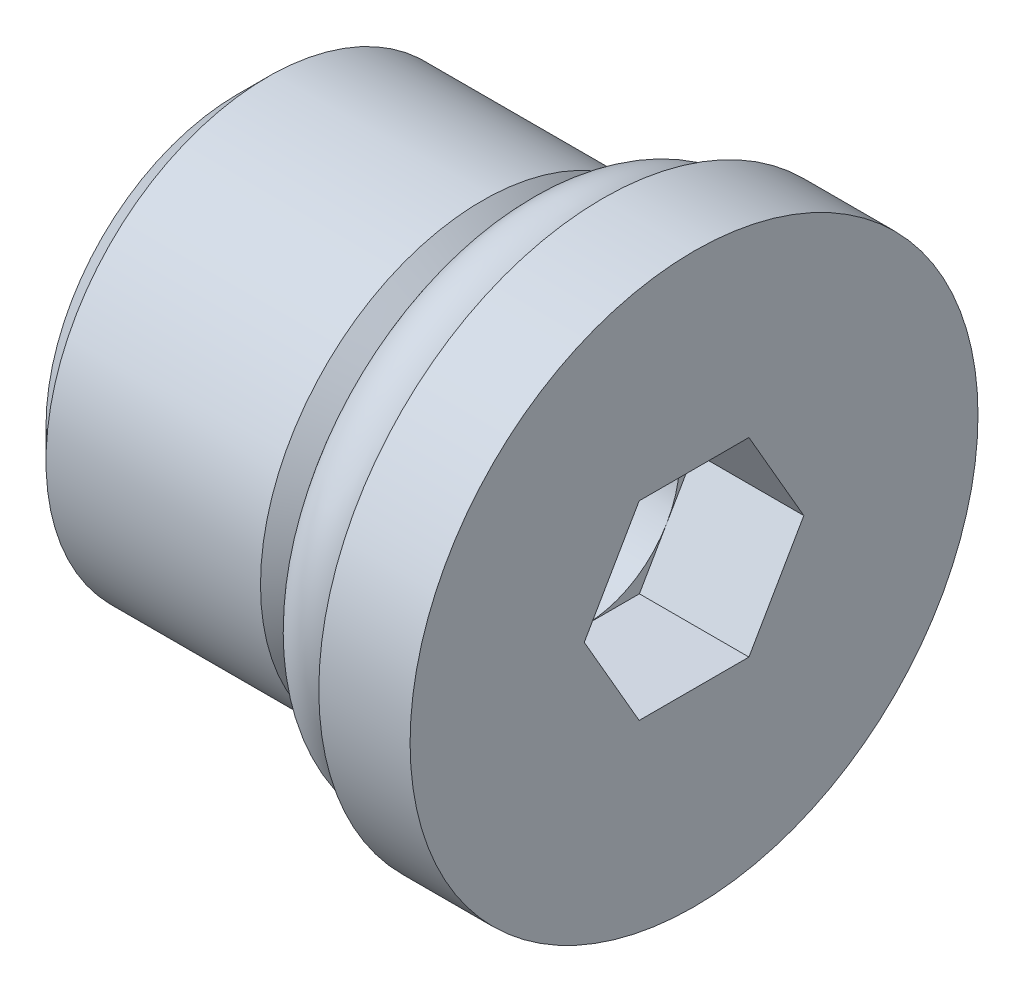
ISO-10303-21;
HEADER;
FILE_DESCRIPTION(('STEP AP214'),'2;1');
FILE_NAME('part.step','',(''),(''),'','','');
FILE_SCHEMA(('AUTOMOTIVE_DESIGN { 1 0 10303 214 1 1 1 1 }'));
ENDSEC;
DATA;
#1=APPLICATION_CONTEXT('core data for automotive mechanical design processes');
#2=APPLICATION_PROTOCOL_DEFINITION('international standard','automotive_design',2000,#1);
#3=PRODUCT_CONTEXT('',#1,'mechanical');
#4=PRODUCT('Part','Part','',(#3));
#5=PRODUCT_RELATED_PRODUCT_CATEGORY('part','',(#4));
#6=PRODUCT_DEFINITION_FORMATION('','',#4);
#7=PRODUCT_DEFINITION_CONTEXT('part definition',#1,'design');
#8=PRODUCT_DEFINITION('design','',#6,#7);
#9=PRODUCT_DEFINITION_SHAPE('','',#8);
#10=(LENGTH_UNIT() NAMED_UNIT(*) SI_UNIT(.MILLI.,.METRE.));
#11=(NAMED_UNIT(*) PLANE_ANGLE_UNIT() SI_UNIT($,.RADIAN.));
#12=(NAMED_UNIT(*) SI_UNIT($,.STERADIAN.) SOLID_ANGLE_UNIT());
#13=UNCERTAINTY_MEASURE_WITH_UNIT(LENGTH_MEASURE(1.E-05),#10,'distance_accuracy_value','');
#14=(GEOMETRIC_REPRESENTATION_CONTEXT(3) GLOBAL_UNCERTAINTY_ASSIGNED_CONTEXT((#13)) GLOBAL_UNIT_ASSIGNED_CONTEXT((#10,
#11,#12)) REPRESENTATION_CONTEXT('',''));
#15=CARTESIAN_POINT('',(0.,0.,0.));
#16=DIRECTION('',(0.,0.,1.));
#17=DIRECTION('',(1.,0.,0.));
#18=AXIS2_PLACEMENT_3D('',#15,#16,#17);
#19=CARTESIAN_POINT('',(0.,0.,2.40030000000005));
#20=DIRECTION('',(-1.,0.,0.));
#21=DIRECTION('',(0.,0.,1.));
#22=AXIS2_PLACEMENT_3D('',#19,#20,#21);
#23=PLANE('',#22);
#24=CARTESIAN_POINT('',(0.,0.,0.));
#25=DIRECTION('',(1.,0.,0.));
#26=DIRECTION('',(0.,0.,-1.));
#27=AXIS2_PLACEMENT_3D('',#24,#25,#26);
#28=CIRCLE('',#27,4.80060000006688);
#29=CARTESIAN_POINT('',(0.,0.,-4.80060000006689));
#30=VERTEX_POINT('',#29);
#31=EDGE_CURVE('P0_E22',#30,#30,#28,.T.);
#32=ORIENTED_EDGE('',*,*,#31,.F.);
#33=EDGE_LOOP('',(#32));
#34=FACE_BOUND('',#33,.T.);
#35=ADVANCED_FACE('P0_F19',(#34),#23,.T.);
#36=CARTESIAN_POINT('',(0.755649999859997,0.,0.));
#37=DIRECTION('',(1.,0.,0.));
#38=DIRECTION('',(0.,0.,-1.));
#39=AXIS2_PLACEMENT_3D('',#36,#37,#38);
#40=CONICAL_SURFACE('',#39,5.55624999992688,0.785398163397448);
#41=CARTESIAN_POINT('',(0.755649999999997,0.,0.));
#42=DIRECTION('',(1.,0.,0.));
#43=DIRECTION('',(0.,0.,-1.));
#44=AXIS2_PLACEMENT_3D('',#41,#42,#43);
#45=CIRCLE('',#44,5.55625);
#46=CARTESIAN_POINT('',(0.755649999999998,0.,-5.55625000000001));
#47=VERTEX_POINT('',#46);
#48=EDGE_CURVE('P0_E202',#47,#47,#45,.T.);
#49=ORIENTED_EDGE('',*,*,#48,.F.);
#50=EDGE_LOOP('',(#49));
#51=FACE_BOUND('',#50,.T.);
#52=ORIENTED_EDGE('',*,*,#31,.T.);
#53=EDGE_LOOP('',(#52));
#54=FACE_BOUND('',#53,.T.);
#55=ADVANCED_FACE('P0_F532',(#51,#54),#40,.T.);
#56=CARTESIAN_POINT('',(8.68679999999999,0.,0.));
#57=DIRECTION('',(-1.,0.,0.));
#58=DIRECTION('',(0.,0.,1.));
#59=AXIS2_PLACEMENT_3D('',#56,#57,#58);
#60=PLANE('',#59);
#61=DIRECTION('',(0.,0.,1.));
#62=VECTOR('',#61,1.);
#63=CARTESIAN_POINT('',(8.68679999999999,-2.38125,0.));
#64=LINE('',#63,#62);
#65=CARTESIAN_POINT('',(8.68679999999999,-2.38125,-1.37481532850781));
#66=VERTEX_POINT('',#65);
#67=CARTESIAN_POINT('',(8.68679999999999,-2.38125,0.));
#68=VERTEX_POINT('',#67);
#69=EDGE_CURVE('P0_E93',#66,#68,#64,.T.);
#70=ORIENTED_EDGE('',*,*,#69,.F.);
#71=DIRECTION('',(0.,-0.86602540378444,0.500000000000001));
#72=VECTOR('',#71,1.);
#73=CARTESIAN_POINT('',(8.68679999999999,-1.190625,-2.06222299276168));
#74=LINE('',#73,#72);
#75=CARTESIAN_POINT('',(8.68679999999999,-1.190625,-2.06222299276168));
#76=VERTEX_POINT('',#75);
#77=EDGE_CURVE('P0_E117',#76,#66,#74,.T.);
#78=ORIENTED_EDGE('',*,*,#77,.F.);
#79=CARTESIAN_POINT('',(8.68679999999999,0.,0.));
#80=DIRECTION('',(-1.,0.,0.));
#81=DIRECTION('',(0.,0.,1.));
#82=AXIS2_PLACEMENT_3D('',#79,#80,#81);
#83=CIRCLE('',#82,2.38125);
#84=EDGE_CURVE('P0_E124',#76,#68,#83,.T.);
#85=ORIENTED_EDGE('',*,*,#84,.T.);
#86=EDGE_LOOP('',(#70,#78,#85));
#87=FACE_BOUND('',#86,.T.);
#88=ADVANCED_FACE('P0_F123',(#87),#60,.F.);
#89=CARTESIAN_POINT('',(8.68679999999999,0.,0.));
#90=DIRECTION('',(-1.,0.,0.));
#91=DIRECTION('',(0.,0.,1.));
#92=AXIS2_PLACEMENT_3D('',#89,#90,#91);
#93=PLANE('',#92);
#94=DIRECTION('',(0.,0.86602540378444,0.500000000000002));
#95=VECTOR('',#94,1.);
#96=CARTESIAN_POINT('',(8.68679999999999,-2.38125000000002,1.37481532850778));
#97=LINE('',#96,#95);
#98=CARTESIAN_POINT('',(8.68679999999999,-2.38125000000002,1.37481532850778));
#99=VERTEX_POINT('',#98);
#100=CARTESIAN_POINT('',(8.68679999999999,-1.190625,2.06222299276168));
#101=VERTEX_POINT('',#100);
#102=EDGE_CURVE('P0_E207',#99,#101,#97,.T.);
#103=ORIENTED_EDGE('',*,*,#102,.F.);
#104=DIRECTION('',(0.,0.,1.));
#105=VECTOR('',#104,1.);
#106=CARTESIAN_POINT('',(8.68679999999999,-2.38125,0.));
#107=LINE('',#106,#105);
#108=EDGE_CURVE('P0_E309',#68,#99,#107,.T.);
#109=ORIENTED_EDGE('',*,*,#108,.F.);
#110=CARTESIAN_POINT('',(8.68679999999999,0.,0.));
#111=DIRECTION('',(-1.,0.,0.));
#112=DIRECTION('',(0.,0.,1.));
#113=AXIS2_PLACEMENT_3D('',#110,#111,#112);
#114=CIRCLE('',#113,2.38125);
#115=EDGE_CURVE('P0_E132',#68,#101,#114,.T.);
#116=ORIENTED_EDGE('',*,*,#115,.T.);
#117=EDGE_LOOP('',(#103,#109,#116));
#118=FACE_BOUND('',#117,.T.);
#119=ADVANCED_FACE('P0_F308',(#118),#93,.F.);
#120=CARTESIAN_POINT('',(3.44169999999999,0.,0.));
#121=DIRECTION('',(1.,0.,0.));
#122=DIRECTION('',(0.,0.,-1.));
#123=AXIS2_PLACEMENT_3D('',#120,#121,#122);
#124=CYLINDRICAL_SURFACE('',#123,5.55625);
#125=CARTESIAN_POINT('',(6.12775000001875,0.,0.));
#126=DIRECTION('',(-1.,0.,0.));
#127=DIRECTION('',(0.,0.,1.));
#128=AXIS2_PLACEMENT_3D('',#125,#126,#127);
#129=CIRCLE('',#128,5.55624999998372);
#130=CARTESIAN_POINT('',(6.12775000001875,0.,5.55624999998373));
#131=VERTEX_POINT('',#130);
#132=EDGE_CURVE('P0_E138',#131,#131,#129,.F.);
#133=ORIENTED_EDGE('',*,*,#132,.F.);
#134=EDGE_LOOP('',(#133));
#135=FACE_BOUND('',#134,.T.);
#136=ORIENTED_EDGE('',*,*,#48,.T.);
#137=EDGE_LOOP('',(#136));
#138=FACE_BOUND('',#137,.T.);
#139=ADVANCED_FACE('P0_F343',(#135,#138),#124,.T.);
#140=CARTESIAN_POINT('',(5.94359999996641,0.,0.));
#141=DIRECTION('',(1.,0.,0.));
#142=DIRECTION('',(0.,0.,-1.));
#143=AXIS2_PLACEMENT_3D('',#140,#141,#142);
#144=CONICAL_SURFACE('',#143,2.3812499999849,1.02974425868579);
#145=CARTESIAN_POINT('',(4.512800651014,0.,0.));
#146=VERTEX_POINT('',#145);
#147=VERTEX_LOOP('',#146);
#148=FACE_BOUND('',#147,.T.);
#149=CARTESIAN_POINT('',(5.94360000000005,0.,0.));
#150=DIRECTION('',(-1.,0.,0.));
#151=DIRECTION('',(0.,0.,1.));
#152=AXIS2_PLACEMENT_3D('',#149,#150,#151);
#153=CIRCLE('',#152,2.38125);
#154=CARTESIAN_POINT('',(5.94360000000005,0.,2.38125));
#155=VERTEX_POINT('',#154);
#156=EDGE_CURVE('P0_E147',#155,#155,#153,.F.);
#157=ORIENTED_EDGE('',*,*,#156,.T.);
#158=EDGE_LOOP('',(#157));
#159=FACE_BOUND('',#158,.T.);
#160=ADVANCED_FACE('P0_F335',(#148,#159),#144,.F.);
#161=CARTESIAN_POINT('',(8.68679999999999,0.,0.));
#162=DIRECTION('',(-1.,0.,0.));
#163=DIRECTION('',(0.,0.,1.));
#164=AXIS2_PLACEMENT_3D('',#161,#162,#163);
#165=PLANE('',#164);
#166=DIRECTION('',(0.,0.,1.));
#167=VECTOR('',#166,1.);
#168=CARTESIAN_POINT('',(8.68679999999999,2.38125,0.));
#169=LINE('',#168,#167);
#170=CARTESIAN_POINT('',(8.68679999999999,2.38125,1.37481532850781));
#171=VERTEX_POINT('',#170);
#172=CARTESIAN_POINT('',(8.68679999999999,2.38125,0.));
#173=VERTEX_POINT('',#172);
#174=EDGE_CURVE('P0_E134',#171,#173,#169,.F.);
#175=ORIENTED_EDGE('',*,*,#174,.F.);
#176=DIRECTION('',(0.,0.86602540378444,-0.500000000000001));
#177=VECTOR('',#176,1.);
#178=CARTESIAN_POINT('',(8.68679999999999,1.190625,2.06222299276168));
#179=LINE('',#178,#177);
#180=CARTESIAN_POINT('',(8.68679999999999,1.190625,2.06222299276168));
#181=VERTEX_POINT('',#180);
#182=EDGE_CURVE('P0_E140',#181,#171,#179,.T.);
#183=ORIENTED_EDGE('',*,*,#182,.F.);
#184=CARTESIAN_POINT('',(8.68679999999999,0.,0.));
#185=DIRECTION('',(-1.,0.,0.));
#186=DIRECTION('',(0.,0.,1.));
#187=AXIS2_PLACEMENT_3D('',#184,#185,#186);
#188=CIRCLE('',#187,2.38125);
#189=EDGE_CURVE('P0_E110',#181,#173,#188,.T.);
#190=ORIENTED_EDGE('',*,*,#189,.T.);
#191=EDGE_LOOP('',(#175,#183,#190));
#192=FACE_BOUND('',#191,.T.);
#193=ADVANCED_FACE('P0_F331',(#192),#165,.F.);
#194=CARTESIAN_POINT('',(6.12774999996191,0.,0.));
#195=DIRECTION('',(-1.,0.,0.));
#196=DIRECTION('',(0.,0.,1.));
#197=AXIS2_PLACEMENT_3D('',#194,#195,#196);
#198=CONICAL_SURFACE('',#197,5.55625000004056,0.785398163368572);
#199=CARTESIAN_POINT('',(7.11200000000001,0.,0.));
#200=DIRECTION('',(1.,0.,0.));
#201=DIRECTION('',(0.,0.,-1.));
#202=AXIS2_PLACEMENT_3D('',#199,#200,#201);
#203=CIRCLE('',#202,4.572);
#204=CARTESIAN_POINT('',(7.11200000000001,0.,-4.57200000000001));
#205=VERTEX_POINT('',#204);
#206=EDGE_CURVE('P0_E109',#205,#205,#203,.T.);
#207=ORIENTED_EDGE('',*,*,#206,.F.);
#208=EDGE_LOOP('',(#207));
#209=FACE_BOUND('',#208,.T.);
#210=ORIENTED_EDGE('',*,*,#132,.T.);
#211=EDGE_LOOP('',(#210));
#212=FACE_BOUND('',#211,.T.);
#213=ADVANCED_FACE('P0_F334',(#209,#212),#198,.T.);
#214=CARTESIAN_POINT('',(8.68679999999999,0.,0.));
#215=DIRECTION('',(-1.,0.,0.));
#216=DIRECTION('',(0.,0.,1.));
#217=AXIS2_PLACEMENT_3D('',#214,#215,#216);
#218=CYLINDRICAL_SURFACE('',#217,2.38125);
#219=CARTESIAN_POINT('',(8.68679999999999,0.,0.));
#220=DIRECTION('',(-1.,0.,0.));
#221=DIRECTION('',(0.,0.,1.));
#222=AXIS2_PLACEMENT_3D('',#219,#220,#221);
#223=CIRCLE('',#222,2.38125);
#224=EDGE_CURVE('P0_E143',#101,#181,#223,.T.);
#225=ORIENTED_EDGE('',*,*,#224,.F.);
#226=ORIENTED_EDGE('',*,*,#115,.F.);
#227=ORIENTED_EDGE('',*,*,#84,.F.);
#228=CARTESIAN_POINT('',(8.68679999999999,0.,0.));
#229=DIRECTION('',(-1.,0.,0.));
#230=DIRECTION('',(0.,0.,1.));
#231=AXIS2_PLACEMENT_3D('',#228,#229,#230);
#232=CIRCLE('',#231,2.38125);
#233=CARTESIAN_POINT('',(8.68679999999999,1.190625,-2.06222299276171));
#234=VERTEX_POINT('',#233);
#235=EDGE_CURVE('P0_E98',#234,#76,#232,.T.);
#236=ORIENTED_EDGE('',*,*,#235,.F.);
#237=CARTESIAN_POINT('',(8.68679999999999,0.,0.));
#238=DIRECTION('',(-1.,0.,0.));
#239=DIRECTION('',(0.,0.,1.));
#240=AXIS2_PLACEMENT_3D('',#237,#238,#239);
#241=CIRCLE('',#240,2.38125);
#242=EDGE_CURVE('P0_E170',#234,#173,#241,.F.);
#243=ORIENTED_EDGE('',*,*,#242,.T.);
#244=ORIENTED_EDGE('',*,*,#189,.F.);
#245=EDGE_LOOP('',(#225,#226,#227,#236,#243,#244));
#246=FACE_BOUND('',#245,.T.);
#247=ORIENTED_EDGE('',*,*,#156,.F.);
#248=EDGE_LOOP('',(#247));
#249=FACE_BOUND('',#248,.T.);
#250=ADVANCED_FACE('P0_F129',(#246,#249),#218,.F.);
#251=CARTESIAN_POINT('',(8.12800000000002,0.,0.));
#252=DIRECTION('',(1.,0.,0.));
#253=DIRECTION('',(0.,0.,-1.));
#254=AXIS2_PLACEMENT_3D('',#251,#252,#253);
#255=CYLINDRICAL_SURFACE('',#254,4.572);
#256=CARTESIAN_POINT('',(9.14400000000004,0.,0.));
#257=DIRECTION('',(1.,0.,0.));
#258=DIRECTION('',(0.,0.,-1.));
#259=AXIS2_PLACEMENT_3D('',#256,#257,#258);
#260=CIRCLE('',#259,4.572);
#261=CARTESIAN_POINT('',(9.14400000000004,0.,-4.57200000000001));
#262=VERTEX_POINT('',#261);
#263=EDGE_CURVE('P0_E164',#262,#262,#260,.T.);
#264=ORIENTED_EDGE('',*,*,#263,.F.);
#265=EDGE_LOOP('',(#264));
#266=FACE_BOUND('',#265,.T.);
#267=ORIENTED_EDGE('',*,*,#206,.T.);
#268=EDGE_LOOP('',(#267));
#269=FACE_BOUND('',#268,.T.);
#270=ADVANCED_FACE('P0_F379',(#266,#269),#255,.T.);
#271=CARTESIAN_POINT('',(8.68679999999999,0.,0.));
#272=DIRECTION('',(-1.,0.,0.));
#273=DIRECTION('',(0.,0.,1.));
#274=AXIS2_PLACEMENT_3D('',#271,#272,#273);
#275=PLANE('',#274);
#276=DIRECTION('',(0.,0.86602540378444,0.500000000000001));
#277=VECTOR('',#276,1.);
#278=CARTESIAN_POINT('',(8.68679999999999,0.,-2.74963065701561));
#279=LINE('',#278,#277);
#280=CARTESIAN_POINT('',(8.68679999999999,2.38125,-1.37481532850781));
#281=VERTEX_POINT('',#280);
#282=EDGE_CURVE('P0_E232',#234,#281,#279,.T.);
#283=ORIENTED_EDGE('',*,*,#282,.T.);
#284=DIRECTION('',(0.,0.,1.));
#285=VECTOR('',#284,1.);
#286=CARTESIAN_POINT('',(8.68679999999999,2.38125,0.));
#287=LINE('',#286,#285);
#288=EDGE_CURVE('P0_E169',#281,#173,#287,.T.);
#289=ORIENTED_EDGE('',*,*,#288,.T.);
#290=ORIENTED_EDGE('',*,*,#242,.F.);
#291=EDGE_LOOP('',(#283,#289,#290));
#292=FACE_BOUND('',#291,.T.);
#293=ADVANCED_FACE('P0_F376',(#292),#275,.F.);
#294=CARTESIAN_POINT('',(8.68679999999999,0.,0.));
#295=DIRECTION('',(-1.,0.,0.));
#296=DIRECTION('',(0.,0.,1.));
#297=AXIS2_PLACEMENT_3D('',#294,#295,#296);
#298=PLANE('',#297);
#299=ORIENTED_EDGE('',*,*,#235,.T.);
#300=DIRECTION('',(0.,0.86602540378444,-0.500000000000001));
#301=VECTOR('',#300,1.);
#302=CARTESIAN_POINT('',(8.68679999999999,-2.38125,-1.37481532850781));
#303=LINE('',#302,#301);
#304=CARTESIAN_POINT('',(8.68679999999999,0.,-2.74963065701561));
#305=VERTEX_POINT('',#304);
#306=EDGE_CURVE('P0_E101',#76,#305,#303,.T.);
#307=ORIENTED_EDGE('',*,*,#306,.T.);
#308=DIRECTION('',(0.,0.86602540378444,0.500000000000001));
#309=VECTOR('',#308,1.);
#310=CARTESIAN_POINT('',(8.68679999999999,0.,-2.74963065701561));
#311=LINE('',#310,#309);
#312=EDGE_CURVE('P0_E103',#305,#234,#311,.T.);
#313=ORIENTED_EDGE('',*,*,#312,.T.);
#314=EDGE_LOOP('',(#299,#307,#313));
#315=FACE_BOUND('',#314,.T.);
#316=ADVANCED_FACE('P0_F100',(#315),#298,.F.);
#317=CARTESIAN_POINT('',(8.68679999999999,0.,0.));
#318=DIRECTION('',(-1.,0.,0.));
#319=DIRECTION('',(0.,0.,1.));
#320=AXIS2_PLACEMENT_3D('',#317,#318,#319);
#321=PLANE('',#320);
#322=ORIENTED_EDGE('',*,*,#224,.T.);
#323=DIRECTION('',(0.,-0.86602540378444,0.500000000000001));
#324=VECTOR('',#323,1.);
#325=CARTESIAN_POINT('',(8.68679999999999,2.38125,1.37481532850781));
#326=LINE('',#325,#324);
#327=CARTESIAN_POINT('',(8.68679999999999,0.,2.74963065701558));
#328=VERTEX_POINT('',#327);
#329=EDGE_CURVE('P0_E211',#181,#328,#326,.T.);
#330=ORIENTED_EDGE('',*,*,#329,.T.);
#331=DIRECTION('',(0.,-0.86602540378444,-0.500000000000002));
#332=VECTOR('',#331,1.);
#333=CARTESIAN_POINT('',(8.68679999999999,0.,2.74963065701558));
#334=LINE('',#333,#332);
#335=EDGE_CURVE('P0_E212',#328,#101,#334,.T.);
#336=ORIENTED_EDGE('',*,*,#335,.T.);
#337=EDGE_LOOP('',(#322,#330,#336));
#338=FACE_BOUND('',#337,.T.);
#339=ADVANCED_FACE('P0_F281',(#338),#321,.F.);
#340=CARTESIAN_POINT('',(9.14400000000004,0.,3.55599999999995));
#341=DIRECTION('',(-1.,0.,0.));
#342=DIRECTION('',(0.,0.,1.));
#343=AXIS2_PLACEMENT_3D('',#340,#341,#342);
#344=PLANE('',#343);
#345=CARTESIAN_POINT('',(9.14400000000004,0.,0.));
#346=DIRECTION('',(1.,0.,0.));
#347=DIRECTION('',(0.,0.,-1.));
#348=AXIS2_PLACEMENT_3D('',#345,#346,#347);
#349=CIRCLE('',#348,7.112);
#350=CARTESIAN_POINT('',(9.14400000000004,0.,-7.11200000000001));
#351=VERTEX_POINT('',#350);
#352=EDGE_CURVE('P0_E156',#351,#351,#349,.T.);
#353=ORIENTED_EDGE('',*,*,#352,.F.);
#354=EDGE_LOOP('',(#353));
#355=FACE_BOUND('',#354,.T.);
#356=ORIENTED_EDGE('',*,*,#263,.T.);
#357=EDGE_LOOP('',(#356));
#358=FACE_BOUND('',#357,.T.);
#359=ADVANCED_FACE('P0_F368',(#355,#358),#344,.T.);
#360=CARTESIAN_POINT('',(11.4300000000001,2.38125,0.));
#361=DIRECTION('',(0.,1.,0.));
#362=DIRECTION('',(0.,0.,1.));
#363=AXIS2_PLACEMENT_3D('',#360,#361,#362);
#364=PLANE('',#363);
#365=DIRECTION('',(0.,0.,1.));
#366=VECTOR('',#365,1.);
#367=CARTESIAN_POINT('',(11.4300000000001,2.38125000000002,3.556));
#368=LINE('',#367,#366);
#369=CARTESIAN_POINT('',(11.4300000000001,2.38125,1.37481532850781));
#370=VERTEX_POINT('',#369);
#371=CARTESIAN_POINT('',(11.4300000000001,2.38125,-1.37481532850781));
#372=VERTEX_POINT('',#371);
#373=EDGE_CURVE('P0_E160',#370,#372,#368,.F.);
#374=ORIENTED_EDGE('',*,*,#373,.F.);
#375=DIRECTION('',(1.,0.,0.));
#376=VECTOR('',#375,1.);
#377=CARTESIAN_POINT('',(11.4300000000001,2.38125,1.37481532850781));
#378=LINE('',#377,#376);
#379=EDGE_CURVE('P0_E161',#370,#171,#378,.F.);
#380=ORIENTED_EDGE('',*,*,#379,.T.);
#381=ORIENTED_EDGE('',*,*,#174,.T.);
#382=ORIENTED_EDGE('',*,*,#288,.F.);
#383=DIRECTION('',(1.,0.,0.));
#384=VECTOR('',#383,1.);
#385=CARTESIAN_POINT('',(11.4300000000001,2.38125,-1.37481532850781));
#386=LINE('',#385,#384);
#387=EDGE_CURVE('P0_E120',#281,#372,#386,.T.);
#388=ORIENTED_EDGE('',*,*,#387,.T.);
#389=EDGE_LOOP('',(#374,#380,#381,#382,#388));
#390=FACE_BOUND('',#389,.T.);
#391=ADVANCED_FACE('P0_F245',(#390),#364,.F.);
#392=CARTESIAN_POINT('',(11.4300000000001,0.,-2.74963065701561));
#393=DIRECTION('',(0.,0.500000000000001,-0.86602540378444));
#394=DIRECTION('',(0.,0.86602540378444,0.500000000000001));
#395=AXIS2_PLACEMENT_3D('',#392,#393,#394);
#396=PLANE('',#395);
#397=DIRECTION('',(0.,-0.86602540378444,-0.500000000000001));
#398=VECTOR('',#397,1.);
#399=CARTESIAN_POINT('',(11.4300000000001,2.38125,-1.37481532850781));
#400=LINE('',#399,#398);
#401=CARTESIAN_POINT('',(11.4300000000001,0.,-2.74963065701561));
#402=VERTEX_POINT('',#401);
#403=EDGE_CURVE('P0_E250',#372,#402,#400,.T.);
#404=ORIENTED_EDGE('',*,*,#403,.F.);
#405=ORIENTED_EDGE('',*,*,#387,.F.);
#406=ORIENTED_EDGE('',*,*,#282,.F.);
#407=ORIENTED_EDGE('',*,*,#312,.F.);
#408=DIRECTION('',(1.,0.,0.));
#409=VECTOR('',#408,1.);
#410=CARTESIAN_POINT('',(11.4300000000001,0.,-2.74963065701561));
#411=LINE('',#410,#409);
#412=EDGE_CURVE('P0_E118',#305,#402,#411,.T.);
#413=ORIENTED_EDGE('',*,*,#412,.T.);
#414=EDGE_LOOP('',(#404,#405,#406,#407,#413));
#415=FACE_BOUND('',#414,.T.);
#416=ADVANCED_FACE('P0_F251',(#415),#396,.F.);
#417=CARTESIAN_POINT('',(11.4300000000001,-2.38125,-1.37481532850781));
#418=DIRECTION('',(0.,-0.500000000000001,-0.86602540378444));
#419=DIRECTION('',(0.,0.86602540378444,-0.500000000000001));
#420=AXIS2_PLACEMENT_3D('',#417,#418,#419);
#421=PLANE('',#420);
#422=DIRECTION('',(0.,-0.86602540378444,0.500000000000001));
#423=VECTOR('',#422,1.);
#424=CARTESIAN_POINT('',(11.4300000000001,0.,-2.74963065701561));
#425=LINE('',#424,#423);
#426=CARTESIAN_POINT('',(11.4300000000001,-2.38125,-1.37481532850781));
#427=VERTEX_POINT('',#426);
#428=EDGE_CURVE('P0_E255',#402,#427,#425,.T.);
#429=ORIENTED_EDGE('',*,*,#428,.F.);
#430=ORIENTED_EDGE('',*,*,#412,.F.);
#431=ORIENTED_EDGE('',*,*,#306,.F.);
#432=ORIENTED_EDGE('',*,*,#77,.T.);
#433=DIRECTION('',(1.,0.,0.));
#434=VECTOR('',#433,1.);
#435=CARTESIAN_POINT('',(11.4300000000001,-2.38125,-1.37481532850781));
#436=LINE('',#435,#434);
#437=EDGE_CURVE('P0_E215',#66,#427,#436,.T.);
#438=ORIENTED_EDGE('',*,*,#437,.T.);
#439=EDGE_LOOP('',(#429,#430,#431,#432,#438));
#440=FACE_BOUND('',#439,.T.);
#441=ADVANCED_FACE('P0_F116',(#440),#421,.F.);
#442=CARTESIAN_POINT('',(11.4300000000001,-2.38125000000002,1.37481532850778));
#443=DIRECTION('',(0.,-1.,0.));
#444=DIRECTION('',(0.,0.,-1.));
#445=AXIS2_PLACEMENT_3D('',#442,#443,#444);
#446=PLANE('',#445);
#447=DIRECTION('',(0.,0.,1.));
#448=VECTOR('',#447,1.);
#449=CARTESIAN_POINT('',(11.4300000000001,-2.38124999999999,3.55600000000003));
#450=LINE('',#449,#448);
#451=CARTESIAN_POINT('',(11.4300000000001,-2.38125000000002,1.37481532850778));
#452=VERTEX_POINT('',#451);
#453=EDGE_CURVE('P0_E293',#427,#452,#450,.T.);
#454=ORIENTED_EDGE('',*,*,#453,.F.);
#455=ORIENTED_EDGE('',*,*,#437,.F.);
#456=ORIENTED_EDGE('',*,*,#69,.T.);
#457=ORIENTED_EDGE('',*,*,#108,.T.);
#458=DIRECTION('',(1.,0.,0.));
#459=VECTOR('',#458,1.);
#460=CARTESIAN_POINT('',(11.4300000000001,-2.38125000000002,1.37481532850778));
#461=LINE('',#460,#459);
#462=EDGE_CURVE('P0_E208',#99,#452,#461,.T.);
#463=ORIENTED_EDGE('',*,*,#462,.T.);
#464=EDGE_LOOP('',(#454,#455,#456,#457,#463));
#465=FACE_BOUND('',#464,.T.);
#466=ADVANCED_FACE('P0_F359',(#465),#446,.F.);
#467=CARTESIAN_POINT('',(11.4300000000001,0.,2.74963065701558));
#468=DIRECTION('',(0.,-0.500000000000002,0.86602540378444));
#469=DIRECTION('',(0.,-0.86602540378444,-0.500000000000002));
#470=AXIS2_PLACEMENT_3D('',#467,#468,#469);
#471=PLANE('',#470);
#472=DIRECTION('',(0.,0.86602540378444,0.500000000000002));
#473=VECTOR('',#472,1.);
#474=CARTESIAN_POINT('',(11.4300000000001,-2.38125000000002,1.37481532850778));
#475=LINE('',#474,#473);
#476=CARTESIAN_POINT('',(11.4300000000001,0.,2.74963065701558));
#477=VERTEX_POINT('',#476);
#478=EDGE_CURVE('P0_E290',#452,#477,#475,.T.);
#479=ORIENTED_EDGE('',*,*,#478,.F.);
#480=ORIENTED_EDGE('',*,*,#462,.F.);
#481=ORIENTED_EDGE('',*,*,#102,.T.);
#482=ORIENTED_EDGE('',*,*,#335,.F.);
#483=DIRECTION('',(1.,0.,0.));
#484=VECTOR('',#483,1.);
#485=CARTESIAN_POINT('',(11.4300000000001,0.,2.74963065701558));
#486=LINE('',#485,#484);
#487=EDGE_CURVE('P0_E39',#328,#477,#486,.T.);
#488=ORIENTED_EDGE('',*,*,#487,.T.);
#489=EDGE_LOOP('',(#479,#480,#481,#482,#488));
#490=FACE_BOUND('',#489,.T.);
#491=ADVANCED_FACE('P0_F285',(#490),#471,.F.);
#492=CARTESIAN_POINT('',(11.4300000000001,2.38125,1.37481532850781));
#493=DIRECTION('',(0.,0.500000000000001,0.86602540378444));
#494=DIRECTION('',(0.,-0.86602540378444,0.500000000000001));
#495=AXIS2_PLACEMENT_3D('',#492,#493,#494);
#496=PLANE('',#495);
#497=DIRECTION('',(0.,0.86602540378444,-0.500000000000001));
#498=VECTOR('',#497,1.);
#499=CARTESIAN_POINT('',(11.4300000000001,0.,2.74963065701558));
#500=LINE('',#499,#498);
#501=EDGE_CURVE('P0_E30',#477,#370,#500,.T.);
#502=ORIENTED_EDGE('',*,*,#501,.F.);
#503=ORIENTED_EDGE('',*,*,#487,.F.);
#504=ORIENTED_EDGE('',*,*,#329,.F.);
#505=ORIENTED_EDGE('',*,*,#182,.T.);
#506=ORIENTED_EDGE('',*,*,#379,.F.);
#507=EDGE_LOOP('',(#502,#503,#504,#505,#506));
#508=FACE_BOUND('',#507,.T.);
#509=ADVANCED_FACE('P0_F288',(#508),#496,.F.);
#510=CARTESIAN_POINT('',(10.287,0.,0.));
#511=DIRECTION('',(1.,0.,0.));
#512=DIRECTION('',(0.,0.,-1.));
#513=AXIS2_PLACEMENT_3D('',#510,#511,#512);
#514=CYLINDRICAL_SURFACE('',#513,7.112);
#515=CARTESIAN_POINT('',(11.4300000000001,0.,0.));
#516=DIRECTION('',(1.,0.,0.));
#517=DIRECTION('',(0.,0.,-1.));
#518=AXIS2_PLACEMENT_3D('',#515,#516,#517);
#519=CIRCLE('',#518,7.112);
#520=CARTESIAN_POINT('',(11.4300000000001,0.,-7.11200000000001));
#521=VERTEX_POINT('',#520);
#522=EDGE_CURVE('P0_E12',#521,#521,#519,.T.);
#523=ORIENTED_EDGE('',*,*,#522,.F.);
#524=EDGE_LOOP('',(#523));
#525=FACE_BOUND('',#524,.T.);
#526=ORIENTED_EDGE('',*,*,#352,.T.);
#527=EDGE_LOOP('',(#526));
#528=FACE_BOUND('',#527,.T.);
#529=ADVANCED_FACE('P0_F347',(#525,#528),#514,.T.);
#530=CARTESIAN_POINT('',(11.4300000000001,0.,3.55599999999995));
#531=DIRECTION('',(1.,0.,0.));
#532=DIRECTION('',(0.,1.,0.));
#533=AXIS2_PLACEMENT_3D('',#530,#531,#532);
#534=PLANE('',#533);
#535=ORIENTED_EDGE('',*,*,#522,.T.);
#536=EDGE_LOOP('',(#535));
#537=FACE_BOUND('',#536,.T.);
#538=ORIENTED_EDGE('',*,*,#478,.T.);
#539=ORIENTED_EDGE('',*,*,#501,.T.);
#540=ORIENTED_EDGE('',*,*,#373,.T.);
#541=ORIENTED_EDGE('',*,*,#403,.T.);
#542=ORIENTED_EDGE('',*,*,#428,.T.);
#543=ORIENTED_EDGE('',*,*,#453,.T.);
#544=EDGE_LOOP('',(#538,#539,#540,#541,#542,#543));
#545=FACE_BOUND('',#544,.T.);
#546=ADVANCED_FACE('P0_F259',(#537,#545),#534,.T.);
#547=CLOSED_SHELL('',(#35,#55,#88,#119,#139,#160,#193,#213,#250,#270,#293,#316,#339,#359,#391,
#416,#441,#466,#491,#509,#529,#546));
#548=MANIFOLD_SOLID_BREP('P0_B1',#547);
#549=CARTESIAN_POINT('',(8.12800000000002,0.,0.));
#550=DIRECTION('',(-1.,0.,0.));
#551=DIRECTION('',(0.,0.,1.));
#552=AXIS2_PLACEMENT_3D('',#549,#550,#551);
#553=TOROIDAL_SURFACE('',#552,5.58800000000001,0.9906);
#554=ADVANCED_FACE('P1_F13',(),#553,.T.);
#555=CLOSED_SHELL('',(#554));
#556=MANIFOLD_SOLID_BREP('P1_B1',#555);
#557=ADVANCED_BREP_SHAPE_REPRESENTATION('',(#18,#548,#556),#14);
#558=SHAPE_DEFINITION_REPRESENTATION(#9,#557);
ENDSEC;
END-ISO-10303-21;
